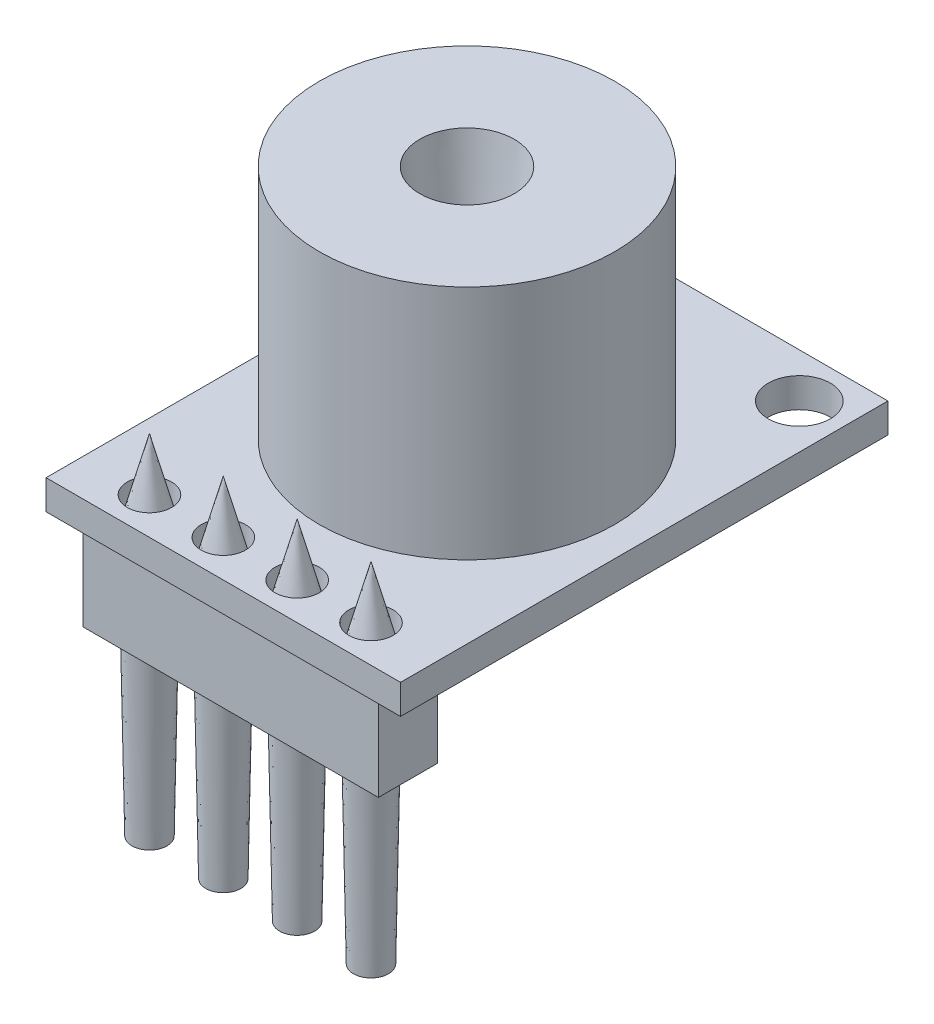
from build123d import *

# Parameters (mm, degrees)
SCHIZZO1_W                             = 12
SCHIZZO1_H                             = 16.5
SCHIZZO1_R                             = 0.75
SCHIZZO1_R_2                           = 1.05
ESTRUSIONE_ESTRUSIONE1_DEPTH           = 1
ESTRUSIONE_ESTRUSIONE2_START           = 1
SCHIZZO1_3_R                           = 5
ESTRUSIONE_ESTRUSIONE2_DEPTH           = 8
SCHIZZO3_W                             = 10
SCHIZZO3_H                             = 2
ESTRUSIONE_ESTRUSIONE4_DEPTH           = 3
SCHIZZO1_5_R                           = 0.75
ESTRUSIONE_ESTRUSIONE5_DEPTH           = 9
ESTRUSIONE_ESTRUSIONE5_DRAFT           = -1
ESTRUSIONE_ESTRUSIONE5_PROFILE_2_DEPTH = 9
ESTRUSIONE_ESTRUSIONE5_PROFILE_2_DRAFT = -1
ESTRUSIONE_ESTRUSIONE5_PROFILE_3_DEPTH = 9
ESTRUSIONE_ESTRUSIONE5_PROFILE_3_DRAFT = -1
ESTRUSIONE_ESTRUSIONE5_PROFILE_4_DEPTH = 9
ESTRUSIONE_ESTRUSIONE5_PROFILE_4_DRAFT = -1
TAGLIO_ESTRUSIONE1_START               = 9
SCHIZZO1_6_R                           = 1.598963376
TAGLIO_ESTRUSIONE1_DEPTH               = 4
TAGLIO_ESTRUSIONE1_DRAFT               = -8


with BuildPart() as part:
    # Schizzo1 → Estrusione-Estrusione1 (new body)
    with BuildSketch(Plane(origin=(0, 0, 0), x_dir=(1, 0, 0), z_dir=(0, 1, 0))):
        Rectangle(SCHIZZO1_W, SCHIZZO1_H)
        with Locations(Location((-3.75, -7, 0), (0, 0, 270))):
            Circle(SCHIZZO1_R, mode=Mode.SUBTRACT)
        with Locations(Location((-1.25, -7, 0), (0, 0, 270))):
            Circle(SCHIZZO1_R, mode=Mode.SUBTRACT)
        with Locations(Location((1.25, -7, 0), (0, 0, 270))):
            Circle(SCHIZZO1_R, mode=Mode.SUBTRACT)
        with Locations(Location((3.75, -7, 0), (0, 0, 270))):
            Circle(SCHIZZO1_R, mode=Mode.SUBTRACT)
        with Locations(Location((4.5, 6.75, 0), (0, 0, 270))):
            Circle(SCHIZZO1_R_2, mode=Mode.SUBTRACT)
        with Locations(Location((-4.5, 6.75, 0), (0, 0, 270))):
            Circle(SCHIZZO1_R_2, mode=Mode.SUBTRACT)
    extrude(amount=ESTRUSIONE_ESTRUSIONE1_DEPTH)


with BuildPart() as body_2:
    # Schizzo1_3 → Estrusione-Estrusione2 (new body)
    with BuildSketch(Plane(origin=(0, 0, 0), x_dir=(1, 0, 0), z_dir=(0, 1, 0)).offset(ESTRUSIONE_ESTRUSIONE2_START)):
        with Locations(Location((0, 0, 0), (0, 0, 270))):
            Circle(SCHIZZO1_3_R)
    extrude(amount=ESTRUSIONE_ESTRUSIONE2_DEPTH)


with BuildPart() as body_3:
    # Estrusione-Estrusione3 cone 1 section (on through the dimple's axis) → Estrusione-Estrusione3 (revolve)
    with BuildSketch(Plane(origin=(-3.75, 0, 7), x_dir=(0, 0, -1), z_dir=(1, 0, 0))):
        Polygon((0, 0), (0.75, 0), (0, 2.799038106), align=None)
    revolve(axis=Axis((-3.75, 0, 7), (0, 1, 0)))


with BuildPart() as body_4:
    # Estrusione-Estrusione3 cone 2 section (on through the dimple's axis) → Estrusione-Estrusione3 cone 2 (revolve)
    with BuildSketch(Plane(origin=(-1.25, 0, 7), x_dir=(0, 0, -1), z_dir=(1, 0, 0))):
        Polygon((0, 0), (0.75, 0), (0, 2.799038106), align=None)
    revolve(axis=Axis((-1.25, 0, 7), (0, 1, 0)))


with BuildPart() as body_5:
    # Estrusione-Estrusione3 cone 3 section (on through the dimple's axis) → Estrusione-Estrusione3 cone 3 (revolve)
    with BuildSketch(Plane(origin=(1.25, 0, 7), x_dir=(0, 0, -1), z_dir=(1, 0, 0))):
        Polygon((0, 0), (0.75, 0), (0, 2.799038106), align=None)
    revolve(axis=Axis((1.25, 0, 7), (0, 1, 0)))


with BuildPart() as body_6:
    # Estrusione-Estrusione3 cone 4 section (on through the dimple's axis) → Estrusione-Estrusione3 cone 4 (revolve)
    with BuildSketch(Plane(origin=(3.75, 0, 7), x_dir=(0, 0, -1), z_dir=(1, 0, 0))):
        Polygon((0, 0), (0.75, 0), (0, 2.799038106), align=None)
    revolve(axis=Axis((3.75, 0, 7), (0, 1, 0)))


with BuildPart() as body_7:
    # Schizzo3 → Estrusione-Estrusione4 (new body)
    with BuildSketch(Plane(origin=(0, 0, 0), x_dir=(1, 0, 0), z_dir=(0, 1, 0))):
        with Locations((0, -7)):
            Rectangle(SCHIZZO3_W, SCHIZZO3_H)
    extrude(amount=-ESTRUSIONE_ESTRUSIONE4_DEPTH)


with BuildPart() as body_8:
    # Schizzo1_5 → Estrusione-Estrusione5 (with draft: the straight prism first)
    with BuildSketch(Plane(origin=(0, 0, 0), x_dir=(1, 0, 0), z_dir=(0, 1, 0))):
        with Locations(Location((-3.75, -7, 0), (0, 0, 270))):
            Circle(SCHIZZO1_5_R)
    extrude(amount=-ESTRUSIONE_ESTRUSIONE5_DEPTH)
    # Estrusione-Estrusione5: the draft: its side faces are tilted about the plane it starts from
    estrusione_estrusione5_sides = [body_8.faces().sort_by_distance(p)[0] for p in [
        (-3.75, -4.5, 6.25),
    ]]
    draft(estrusione_estrusione5_sides, Plane(origin=(0, 0, 0), x_dir=(1, 0, 0), z_dir=(0, 1, 0)), ESTRUSIONE_ESTRUSIONE5_DRAFT)


with BuildPart() as body_9:
    # Schizzo1_5 → Estrusione-Estrusione5 profile 2 (with draft: the straight prism first)
    with BuildSketch(Plane(origin=(0, 0, 0), x_dir=(1, 0, 0), z_dir=(0, 1, 0))):
        with Locations(Location((-1.25, -7, 0), (0, 0, 270))):
            Circle(SCHIZZO1_5_R)
    extrude(amount=-ESTRUSIONE_ESTRUSIONE5_PROFILE_2_DEPTH)
    # Estrusione-Estrusione5 profile 2: the draft: its side faces are tilted about the plane it starts from
    estrusione_estrusione5_profile_2_sides = [body_9.faces().sort_by_distance(p)[0] for p in [
        (-1.25, -4.5, 6.25),
    ]]
    draft(estrusione_estrusione5_profile_2_sides, Plane(origin=(0, 0, 0), x_dir=(1, 0, 0), z_dir=(0, 1, 0)), ESTRUSIONE_ESTRUSIONE5_PROFILE_2_DRAFT)


with BuildPart() as body_10:
    # Schizzo1_5 → Estrusione-Estrusione5 profile 3 (with draft: the straight prism first)
    with BuildSketch(Plane(origin=(0, 0, 0), x_dir=(1, 0, 0), z_dir=(0, 1, 0))):
        with Locations(Location((1.25, -7, 0), (0, 0, 270))):
            Circle(SCHIZZO1_5_R)
    extrude(amount=-ESTRUSIONE_ESTRUSIONE5_PROFILE_3_DEPTH)
    # Estrusione-Estrusione5 profile 3: the draft: its side faces are tilted about the plane it starts from
    estrusione_estrusione5_profile_3_sides = [body_10.faces().sort_by_distance(p)[0] for p in [
        (1.25, -4.5, 6.25),
    ]]
    draft(estrusione_estrusione5_profile_3_sides, Plane(origin=(0, 0, 0), x_dir=(1, 0, 0), z_dir=(0, 1, 0)), ESTRUSIONE_ESTRUSIONE5_PROFILE_3_DRAFT)


with BuildPart() as body_11:
    # Schizzo1_5 → Estrusione-Estrusione5 profile 4 (with draft: the straight prism first)
    with BuildSketch(Plane(origin=(0, 0, 0), x_dir=(1, 0, 0), z_dir=(0, 1, 0))):
        with Locations(Location((3.75, -7, 0), (0, 0, 270))):
            Circle(SCHIZZO1_5_R)
    extrude(amount=-ESTRUSIONE_ESTRUSIONE5_PROFILE_4_DEPTH)
    # Estrusione-Estrusione5 profile 4: the draft: its side faces are tilted about the plane it starts from
    estrusione_estrusione5_profile_4_sides = [body_11.faces().sort_by_distance(p)[0] for p in [
        (3.75, -4.5, 6.25),
    ]]
    draft(estrusione_estrusione5_profile_4_sides, Plane(origin=(0, 0, 0), x_dir=(1, 0, 0), z_dir=(0, 1, 0)), ESTRUSIONE_ESTRUSIONE5_PROFILE_4_DRAFT)


with BuildPart() as taglio_estrusione1_tool:
    # Schizzo1_6 → Taglio-Estrusione1 (with draft: the straight prism first)
    with BuildSketch(Plane(origin=(0, 0, 0), x_dir=(1, 0, 0), z_dir=(0, 1, 0)).offset(TAGLIO_ESTRUSIONE1_START)):
        Circle(SCHIZZO1_6_R)
    extrude(amount=-TAGLIO_ESTRUSIONE1_DEPTH)
    # Taglio-Estrusione1: the draft: its side faces are tilted about the plane it starts from
    taglio_estrusione1_sides = [taglio_estrusione1_tool.faces().sort_by_distance(p)[0] for p in [
        (-1.598963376, 7, 0),
    ]]
    draft(taglio_estrusione1_sides, Plane(origin=(0, 0, 0), x_dir=(1, 0, 0), z_dir=(0, 1, 0)).offset(TAGLIO_ESTRUSIONE1_START), TAGLIO_ESTRUSIONE1_DRAFT)


with BuildPart() as body_2_1:
    add(body_2.part)

    # Taglio-Estrusione1: cut by taglio_estrusione1_tool
    add(taglio_estrusione1_tool.part, mode=Mode.SUBTRACT)


solid = Compound([part.part, body_3.part, body_4.part, body_5.part, body_6.part, body_7.part, body_8.part, body_9.part, body_10.part, body_11.part, body_2_1.part])
